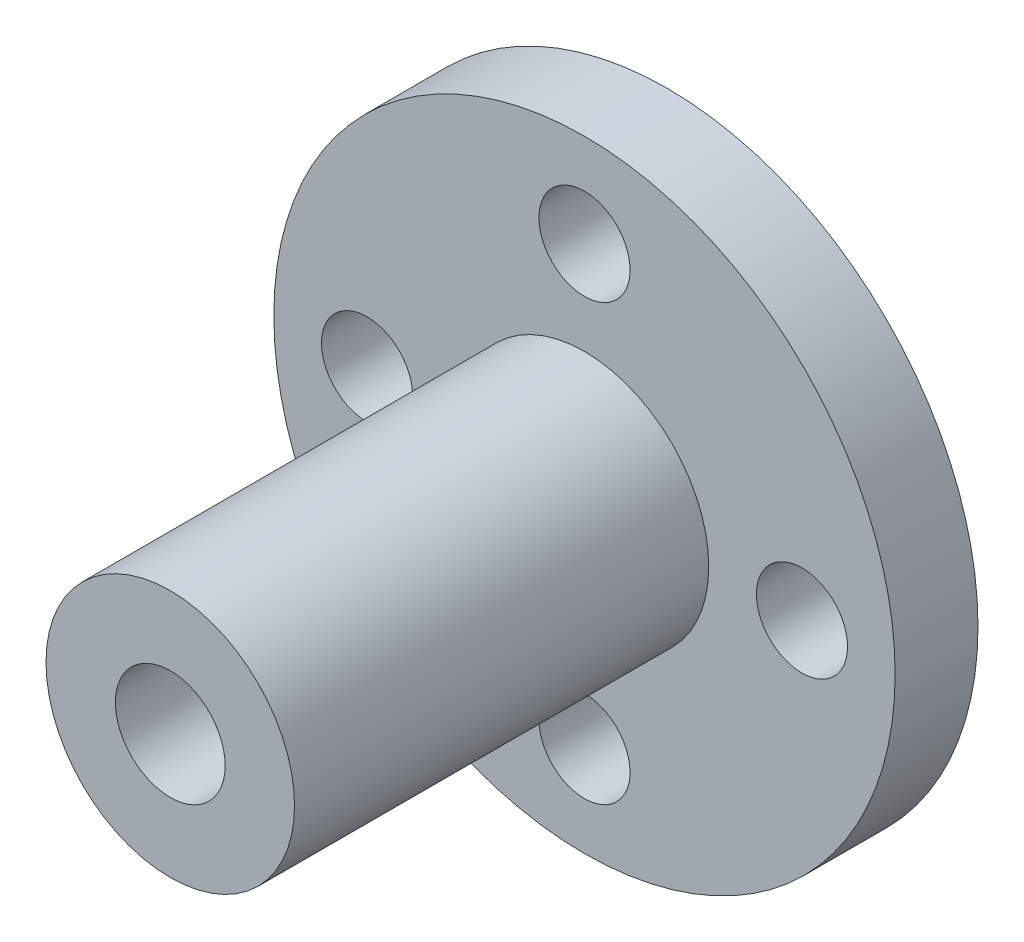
from build123d import *

# Parameters (mm, degrees)
SKETCH1_R         = 75
EXTRUDE1_DEPTH    = 20
SKETCH2_R         = 11
EXTRUDE2_DEPTH    = 108.935165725
CIRPATTERN1_COUNT = 4
SKETCH4_R         = 30
EXTRUDE4_DEPTH    = 100
SKETCH3_R         = 13.25
EXTRUDE3_DEPTH    = 161.15617378


with BuildPart() as part:
    # Sketch1 → Extrude1 (new body)
    with BuildSketch(Plane.XY):
        Circle(SKETCH1_R)
    extrude(amount=EXTRUDE1_DEPTH)

    # Sketch2 → Extrude2 (cut, through all)
    with BuildSketch(Plane.XY.offset(20)):
        with Locations((52.5, 0)):
            Circle(SKETCH2_R)
    extrude2 = extrude(amount=-EXTRUDE2_DEPTH, mode=Mode.SUBTRACT)

    # CirPattern1: Extrude2 ×4 about axis
    cirpattern1_axis = Axis((0, 0, 0), (0, 0, 1))
    for i in range(1, CIRPATTERN1_COUNT):
        add(extrude2.rotate(cirpattern1_axis, i * 360 / CIRPATTERN1_COUNT), mode=Mode.SUBTRACT)

    # Sketch4 → Extrude4 (add)
    with BuildSketch(Plane(origin=(0, 0, 20), x_dir=(-1, 0, 0), z_dir=(0, 0, -1))):
        Circle(SKETCH4_R)
    extrude(amount=-EXTRUDE4_DEPTH)

    # Sketch3 → Extrude3 (cut, through all)
    with BuildSketch(Plane.XY):
        Circle(SKETCH3_R)
    extrude(amount=EXTRUDE3_DEPTH, mode=Mode.SUBTRACT)


solid = part.part
